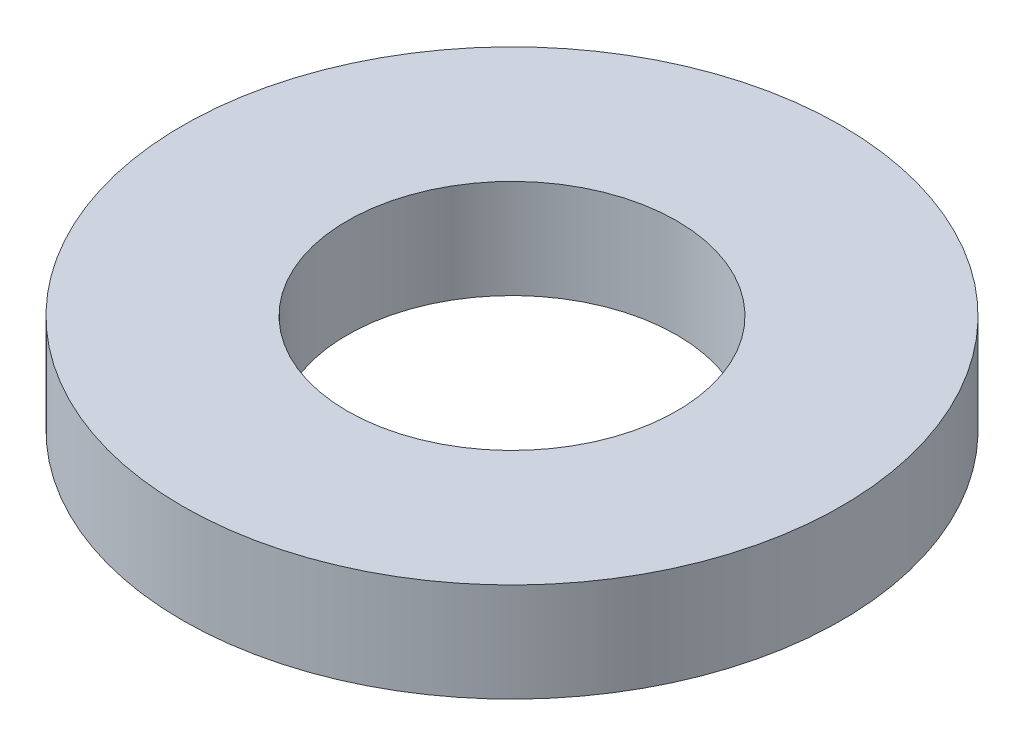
ISO-10303-21;
HEADER;
FILE_DESCRIPTION(('STEP AP214'),'2;1');
FILE_NAME('part.step','',(''),(''),'','','');
FILE_SCHEMA(('AUTOMOTIVE_DESIGN { 1 0 10303 214 1 1 1 1 }'));
ENDSEC;
DATA;
#1=APPLICATION_CONTEXT('core data for automotive mechanical design processes');
#2=APPLICATION_PROTOCOL_DEFINITION('international standard','automotive_design',2000,#1);
#3=PRODUCT_CONTEXT('',#1,'mechanical');
#4=PRODUCT('Part','Part','',(#3));
#5=PRODUCT_RELATED_PRODUCT_CATEGORY('part','',(#4));
#6=PRODUCT_DEFINITION_FORMATION('','',#4);
#7=PRODUCT_DEFINITION_CONTEXT('part definition',#1,'design');
#8=PRODUCT_DEFINITION('design','',#6,#7);
#9=PRODUCT_DEFINITION_SHAPE('','',#8);
#10=(LENGTH_UNIT() NAMED_UNIT(*) SI_UNIT(.MILLI.,.METRE.));
#11=(NAMED_UNIT(*) PLANE_ANGLE_UNIT() SI_UNIT($,.RADIAN.));
#12=(NAMED_UNIT(*) SI_UNIT($,.STERADIAN.) SOLID_ANGLE_UNIT());
#13=UNCERTAINTY_MEASURE_WITH_UNIT(LENGTH_MEASURE(1.E-05),#10,'distance_accuracy_value','');
#14=(GEOMETRIC_REPRESENTATION_CONTEXT(3) GLOBAL_UNCERTAINTY_ASSIGNED_CONTEXT((#13)) GLOBAL_UNIT_ASSIGNED_CONTEXT((#10,
#11,#12)) REPRESENTATION_CONTEXT('',''));
#15=CARTESIAN_POINT('',(0.,0.,0.));
#16=DIRECTION('',(0.,0.,1.));
#17=DIRECTION('',(1.,0.,0.));
#18=AXIS2_PLACEMENT_3D('',#15,#16,#17);
#19=CARTESIAN_POINT('',(0.,15.,0.));
#20=DIRECTION('',(0.,1.,0.));
#21=DIRECTION('',(0.,0.,1.));
#22=AXIS2_PLACEMENT_3D('',#19,#20,#21);
#23=PLANE('',#22);
#24=CARTESIAN_POINT('',(0.,15.,0.));
#25=DIRECTION('',(0.,1.,0.));
#26=DIRECTION('',(0.,0.,1.));
#27=AXIS2_PLACEMENT_3D('',#24,#25,#26);
#28=CIRCLE('',#27,100.);
#29=CARTESIAN_POINT('',(0.,15.,100.));
#30=VERTEX_POINT('',#29);
#31=EDGE_CURVE('E10',#30,#30,#28,.T.);
#32=ORIENTED_EDGE('',*,*,#31,.T.);
#33=EDGE_LOOP('',(#32));
#34=FACE_BOUND('',#33,.T.);
#35=CARTESIAN_POINT('',(0.,15.,0.));
#36=DIRECTION('',(0.,1.,0.));
#37=DIRECTION('',(0.,0.,1.));
#38=AXIS2_PLACEMENT_3D('',#35,#36,#37);
#39=CIRCLE('',#38,50.);
#40=CARTESIAN_POINT('',(0.,15.,50.));
#41=VERTEX_POINT('',#40);
#42=EDGE_CURVE('E42',#41,#41,#39,.T.);
#43=ORIENTED_EDGE('',*,*,#42,.F.);
#44=EDGE_LOOP('',(#43));
#45=FACE_BOUND('',#44,.T.);
#46=ADVANCED_FACE('F31',(#34,#45),#23,.T.);
#47=CARTESIAN_POINT('',(0.,-15.,0.));
#48=DIRECTION('',(0.,1.,0.));
#49=DIRECTION('',(0.,0.,1.));
#50=AXIS2_PLACEMENT_3D('',#47,#48,#49);
#51=PLANE('',#50);
#52=CARTESIAN_POINT('',(0.,-15.,0.));
#53=DIRECTION('',(0.,1.,0.));
#54=DIRECTION('',(0.,0.,1.));
#55=AXIS2_PLACEMENT_3D('',#52,#53,#54);
#56=CIRCLE('',#55,100.);
#57=CARTESIAN_POINT('',(0.,-15.,100.));
#58=VERTEX_POINT('',#57);
#59=EDGE_CURVE('E35',#58,#58,#56,.T.);
#60=ORIENTED_EDGE('',*,*,#59,.F.);
#61=EDGE_LOOP('',(#60));
#62=FACE_BOUND('',#61,.T.);
#63=CARTESIAN_POINT('',(0.,-15.,0.));
#64=DIRECTION('',(0.,1.,0.));
#65=DIRECTION('',(0.,0.,1.));
#66=AXIS2_PLACEMENT_3D('',#63,#64,#65);
#67=CIRCLE('',#66,50.);
#68=CARTESIAN_POINT('',(0.,-15.,50.));
#69=VERTEX_POINT('',#68);
#70=EDGE_CURVE('E44',#69,#69,#67,.T.);
#71=ORIENTED_EDGE('',*,*,#70,.T.);
#72=EDGE_LOOP('',(#71));
#73=FACE_BOUND('',#72,.T.);
#74=ADVANCED_FACE('F54',(#62,#73),#51,.F.);
#75=CARTESIAN_POINT('',(0.,15.,0.));
#76=DIRECTION('',(0.,-1.,0.));
#77=DIRECTION('',(0.,0.,-1.));
#78=AXIS2_PLACEMENT_3D('',#75,#76,#77);
#79=CYLINDRICAL_SURFACE('',#78,100.);
#80=ORIENTED_EDGE('',*,*,#31,.F.);
#81=EDGE_LOOP('',(#80));
#82=FACE_BOUND('',#81,.T.);
#83=ORIENTED_EDGE('',*,*,#59,.T.);
#84=EDGE_LOOP('',(#83));
#85=FACE_BOUND('',#84,.T.);
#86=ADVANCED_FACE('F33',(#82,#85),#79,.T.);
#87=CARTESIAN_POINT('',(0.,15.,0.));
#88=DIRECTION('',(0.,-1.,0.));
#89=DIRECTION('',(0.,0.,-1.));
#90=AXIS2_PLACEMENT_3D('',#87,#88,#89);
#91=CYLINDRICAL_SURFACE('',#90,50.);
#92=ORIENTED_EDGE('',*,*,#42,.T.);
#93=EDGE_LOOP('',(#92));
#94=FACE_BOUND('',#93,.T.);
#95=ORIENTED_EDGE('',*,*,#70,.F.);
#96=EDGE_LOOP('',(#95));
#97=FACE_BOUND('',#96,.T.);
#98=ADVANCED_FACE('F50',(#94,#97),#91,.F.);
#99=CLOSED_SHELL('',(#46,#74,#86,#98));
#100=MANIFOLD_SOLID_BREP('B2',#99);
#101=ADVANCED_BREP_SHAPE_REPRESENTATION('',(#18,#100),#14);
#102=SHAPE_DEFINITION_REPRESENTATION(#9,#101);
ENDSEC;
END-ISO-10303-21;
